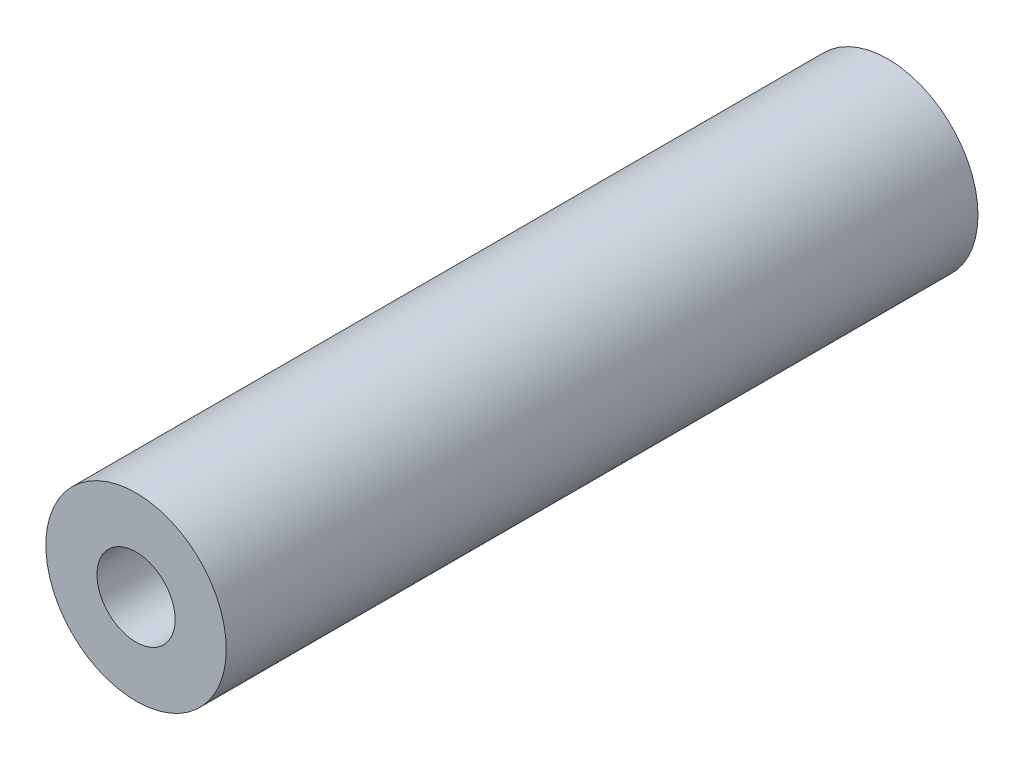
ISO-10303-21;
HEADER;
FILE_DESCRIPTION(('STEP AP214'),'2;1');
FILE_NAME('part.step','',(''),(''),'','','');
FILE_SCHEMA(('AUTOMOTIVE_DESIGN { 1 0 10303 214 1 1 1 1 }'));
ENDSEC;
DATA;
#1=APPLICATION_CONTEXT('core data for automotive mechanical design processes');
#2=APPLICATION_PROTOCOL_DEFINITION('international standard','automotive_design',2000,#1);
#3=PRODUCT_CONTEXT('',#1,'mechanical');
#4=PRODUCT('Part','Part','',(#3));
#5=PRODUCT_RELATED_PRODUCT_CATEGORY('part','',(#4));
#6=PRODUCT_DEFINITION_FORMATION('','',#4);
#7=PRODUCT_DEFINITION_CONTEXT('part definition',#1,'design');
#8=PRODUCT_DEFINITION('design','',#6,#7);
#9=PRODUCT_DEFINITION_SHAPE('','',#8);
#10=(LENGTH_UNIT() NAMED_UNIT(*) SI_UNIT(.MILLI.,.METRE.));
#11=(NAMED_UNIT(*) PLANE_ANGLE_UNIT() SI_UNIT($,.RADIAN.));
#12=(NAMED_UNIT(*) SI_UNIT($,.STERADIAN.) SOLID_ANGLE_UNIT());
#13=UNCERTAINTY_MEASURE_WITH_UNIT(LENGTH_MEASURE(1.E-05),#10,'distance_accuracy_value','');
#14=(GEOMETRIC_REPRESENTATION_CONTEXT(3) GLOBAL_UNCERTAINTY_ASSIGNED_CONTEXT((#13)) GLOBAL_UNIT_ASSIGNED_CONTEXT((#10,
#11,#12)) REPRESENTATION_CONTEXT('',''));
#15=CARTESIAN_POINT('',(0.,0.,0.));
#16=DIRECTION('',(0.,0.,1.));
#17=DIRECTION('',(1.,0.,0.));
#18=AXIS2_PLACEMENT_3D('',#15,#16,#17);
#19=CARTESIAN_POINT('',(0.,0.,-25.));
#20=DIRECTION('',(0.,0.,1.));
#21=DIRECTION('',(1.,0.,0.));
#22=AXIS2_PLACEMENT_3D('',#19,#20,#21);
#23=CYLINDRICAL_SURFACE('',#22,2.6);
#24=CARTESIAN_POINT('',(0.,0.,-13.));
#25=DIRECTION('',(0.,0.,1.));
#26=DIRECTION('',(1.,0.,0.));
#27=AXIS2_PLACEMENT_3D('',#24,#25,#26);
#28=CIRCLE('',#27,2.6);
#29=CARTESIAN_POINT('',(2.6,0.,-13.));
#30=VERTEX_POINT('',#29);
#31=EDGE_CURVE('E57',#30,#30,#28,.T.);
#32=ORIENTED_EDGE('',*,*,#31,.T.);
#33=EDGE_LOOP('',(#32));
#34=FACE_BOUND('',#33,.T.);
#35=CARTESIAN_POINT('',(0.,0.,-25.));
#36=DIRECTION('',(0.,0.,1.));
#37=DIRECTION('',(1.,0.,0.));
#38=AXIS2_PLACEMENT_3D('',#35,#36,#37);
#39=CIRCLE('',#38,2.6);
#40=CARTESIAN_POINT('',(2.6,0.,-25.));
#41=VERTEX_POINT('',#40);
#42=EDGE_CURVE('E10',#41,#41,#39,.T.);
#43=ORIENTED_EDGE('',*,*,#42,.F.);
#44=EDGE_LOOP('',(#43));
#45=FACE_BOUND('',#44,.T.);
#46=ADVANCED_FACE('F35',(#34,#45),#23,.F.);
#47=CARTESIAN_POINT('',(6.,0.,-25.));
#48=DIRECTION('',(0.,0.,-1.));
#49=DIRECTION('',(-1.,0.,0.));
#50=AXIS2_PLACEMENT_3D('',#47,#48,#49);
#51=PLANE('',#50);
#52=ORIENTED_EDGE('',*,*,#42,.T.);
#53=EDGE_LOOP('',(#52));
#54=FACE_BOUND('',#53,.T.);
#55=CARTESIAN_POINT('',(0.,0.,-25.));
#56=DIRECTION('',(0.,0.,1.));
#57=DIRECTION('',(1.,0.,0.));
#58=AXIS2_PLACEMENT_3D('',#55,#56,#57);
#59=CIRCLE('',#58,6.);
#60=CARTESIAN_POINT('',(6.,0.,-25.));
#61=VERTEX_POINT('',#60);
#62=EDGE_CURVE('E41',#61,#61,#59,.T.);
#63=ORIENTED_EDGE('',*,*,#62,.F.);
#64=EDGE_LOOP('',(#63));
#65=FACE_BOUND('',#64,.T.);
#66=ADVANCED_FACE('F74',(#54,#65),#51,.T.);
#67=CARTESIAN_POINT('',(0.,0.,-25.));
#68=DIRECTION('',(0.,0.,1.));
#69=DIRECTION('',(1.,0.,0.));
#70=AXIS2_PLACEMENT_3D('',#67,#68,#69);
#71=CYLINDRICAL_SURFACE('',#70,6.);
#72=ORIENTED_EDGE('',*,*,#62,.T.);
#73=EDGE_LOOP('',(#72));
#74=FACE_BOUND('',#73,.T.);
#75=CARTESIAN_POINT('',(0.,0.,25.));
#76=DIRECTION('',(0.,0.,1.));
#77=DIRECTION('',(1.,0.,0.));
#78=AXIS2_PLACEMENT_3D('',#75,#76,#77);
#79=CIRCLE('',#78,6.);
#80=CARTESIAN_POINT('',(6.,0.,25.));
#81=VERTEX_POINT('',#80);
#82=EDGE_CURVE('E45',#81,#81,#79,.T.);
#83=ORIENTED_EDGE('',*,*,#82,.F.);
#84=EDGE_LOOP('',(#83));
#85=FACE_BOUND('',#84,.T.);
#86=ADVANCED_FACE('F78',(#74,#85),#71,.T.);
#87=CARTESIAN_POINT('',(2.6,0.,25.));
#88=DIRECTION('',(0.,0.,1.));
#89=DIRECTION('',(1.,0.,0.));
#90=AXIS2_PLACEMENT_3D('',#87,#88,#89);
#91=PLANE('',#90);
#92=ORIENTED_EDGE('',*,*,#82,.T.);
#93=EDGE_LOOP('',(#92));
#94=FACE_BOUND('',#93,.T.);
#95=CARTESIAN_POINT('',(0.,0.,25.));
#96=DIRECTION('',(0.,0.,1.));
#97=DIRECTION('',(1.,0.,0.));
#98=AXIS2_PLACEMENT_3D('',#95,#96,#97);
#99=CIRCLE('',#98,2.6);
#100=CARTESIAN_POINT('',(2.6,0.,25.));
#101=VERTEX_POINT('',#100);
#102=EDGE_CURVE('E49',#101,#101,#99,.T.);
#103=ORIENTED_EDGE('',*,*,#102,.F.);
#104=EDGE_LOOP('',(#103));
#105=FACE_BOUND('',#104,.T.);
#106=ADVANCED_FACE('F82',(#94,#105),#91,.T.);
#107=CARTESIAN_POINT('',(0.,0.,-25.));
#108=DIRECTION('',(0.,0.,1.));
#109=DIRECTION('',(1.,0.,0.));
#110=AXIS2_PLACEMENT_3D('',#107,#108,#109);
#111=CYLINDRICAL_SURFACE('',#110,2.6);
#112=ORIENTED_EDGE('',*,*,#102,.T.);
#113=EDGE_LOOP('',(#112));
#114=FACE_BOUND('',#113,.T.);
#115=CARTESIAN_POINT('',(0.,0.,13.));
#116=DIRECTION('',(0.,0.,1.));
#117=DIRECTION('',(1.,0.,0.));
#118=AXIS2_PLACEMENT_3D('',#115,#116,#117);
#119=CIRCLE('',#118,2.6);
#120=CARTESIAN_POINT('',(2.6,0.,13.));
#121=VERTEX_POINT('',#120);
#122=EDGE_CURVE('E54',#121,#121,#119,.T.);
#123=ORIENTED_EDGE('',*,*,#122,.F.);
#124=EDGE_LOOP('',(#123));
#125=FACE_BOUND('',#124,.T.);
#126=ADVANCED_FACE('F70',(#114,#125),#111,.F.);
#127=CARTESIAN_POINT('',(0.,0.,13.));
#128=DIRECTION('',(0.,0.,1.));
#129=DIRECTION('',(1.,0.,0.));
#130=AXIS2_PLACEMENT_3D('',#127,#128,#129);
#131=PLANE('',#130);
#132=ORIENTED_EDGE('',*,*,#122,.T.);
#133=EDGE_LOOP('',(#132));
#134=FACE_BOUND('',#133,.T.);
#135=ADVANCED_FACE('F65',(#134),#131,.T.);
#136=CARTESIAN_POINT('',(2.6,0.,-13.));
#137=DIRECTION('',(0.,0.,-1.));
#138=DIRECTION('',(-1.,0.,0.));
#139=AXIS2_PLACEMENT_3D('',#136,#137,#138);
#140=PLANE('',#139);
#141=ORIENTED_EDGE('',*,*,#31,.F.);
#142=EDGE_LOOP('',(#141));
#143=FACE_BOUND('',#142,.T.);
#144=ADVANCED_FACE('F63',(#143),#140,.T.);
#145=CLOSED_SHELL('',(#46,#66,#86,#106,#126,#135,#144));
#146=MANIFOLD_SOLID_BREP('B2',#145);
#147=ADVANCED_BREP_SHAPE_REPRESENTATION('',(#18,#146),#14);
#148=SHAPE_DEFINITION_REPRESENTATION(#9,#147);
ENDSEC;
END-ISO-10303-21;
